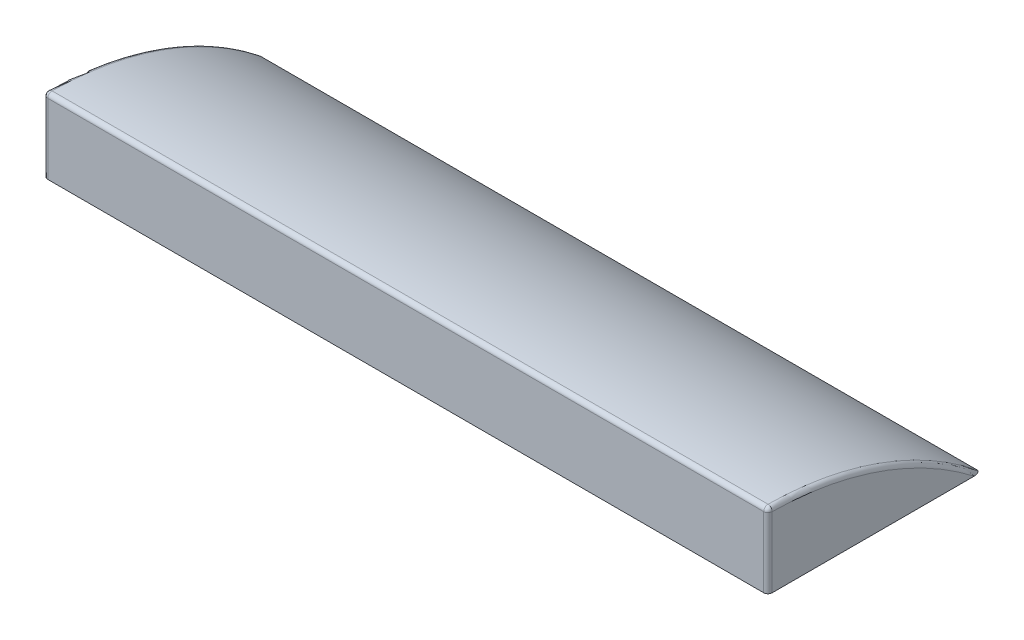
from build123d import *

# Parameters (mm, degrees)
BOSS_EXTRU_1_DEPTH      = 850
ESQUISSE2_R             = 5
ENL_V_MAT_EXTRU_1_DEPTH = 10
CONG_1_R                = 10


with BuildPart() as part:
    # Esquisse1 → Boss.-Extru.1 (new, symmetric)
    with BuildSketch(Plane(origin=(0, 0, 0), x_dir=(0, 0, -1), z_dir=(1, 0, 0))):
        with BuildLine():
            Line((0, 0), (500, 0))
            ThreePointArc((500, 0), (264.905425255, 130.0869293), (0, 175))
            Line((0, 175), (0, 0))
        make_face()
    extrude(amount=BOSS_EXTRU_1_DEPTH, both=True)

    # Esquisse2 → Enl_v. mat.-Extru.1 (cut)
    with BuildSketch(Plane.XZ):
        with Locations(Location((-250, -250, 0), (0, 0, 270))):
            Circle(ESQUISSE2_R)
        with Locations(Location((250, -250, 0), (0, 0, 90))):
            Circle(ESQUISSE2_R)
    extrude(amount=-ENL_V_MAT_EXTRU_1_DEPTH, mode=Mode.SUBTRACT)

    # Cong_1
    cong_1_edges = [part.edges().sort_by_distance(p)[0] for p in [
        (850, 130.0869293, -264.905425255),
        (-850, 130.0869293, -264.905425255),
        (850, 87.5, 0),
        (-850, 87.5, 0),
        (0, 175, 0),
    ]]
    fillet(cong_1_edges, radius=CONG_1_R)


solid = part.part
